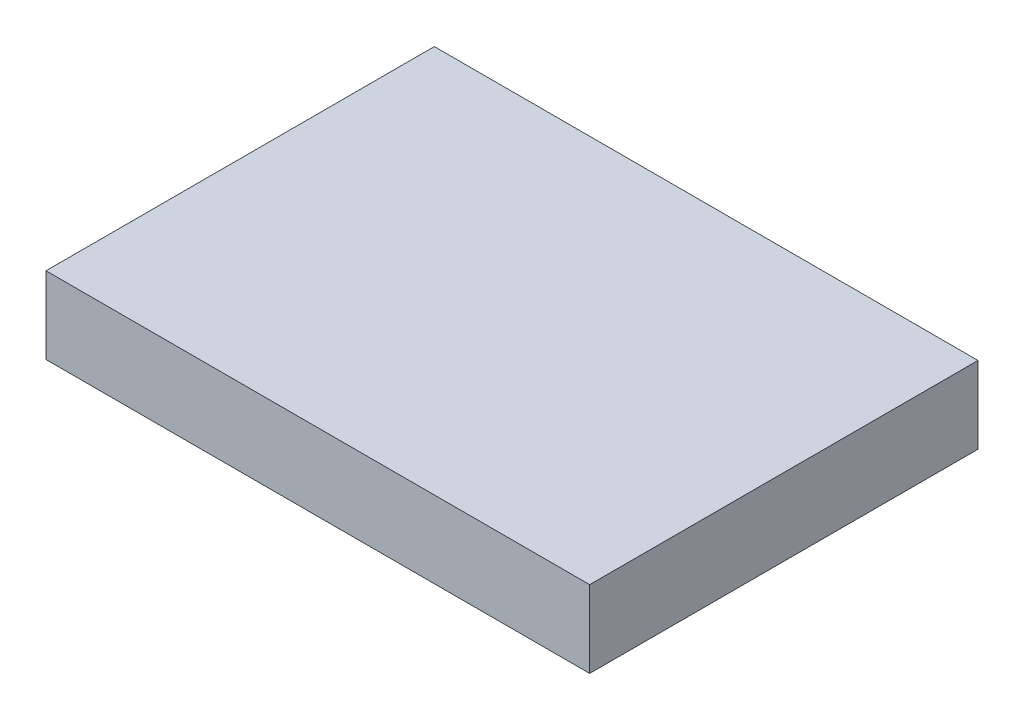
ISO-10303-21;
HEADER;
FILE_DESCRIPTION(('STEP AP214'),'2;1');
FILE_NAME('part.step','',(''),(''),'','','');
FILE_SCHEMA(('AUTOMOTIVE_DESIGN { 1 0 10303 214 1 1 1 1 }'));
ENDSEC;
DATA;
#1=APPLICATION_CONTEXT('core data for automotive mechanical design processes');
#2=APPLICATION_PROTOCOL_DEFINITION('international standard','automotive_design',2000,#1);
#3=PRODUCT_CONTEXT('',#1,'mechanical');
#4=PRODUCT('Part','Part','',(#3));
#5=PRODUCT_RELATED_PRODUCT_CATEGORY('part','',(#4));
#6=PRODUCT_DEFINITION_FORMATION('','',#4);
#7=PRODUCT_DEFINITION_CONTEXT('part definition',#1,'design');
#8=PRODUCT_DEFINITION('design','',#6,#7);
#9=PRODUCT_DEFINITION_SHAPE('','',#8);
#10=(LENGTH_UNIT() NAMED_UNIT(*) SI_UNIT(.MILLI.,.METRE.));
#11=(NAMED_UNIT(*) PLANE_ANGLE_UNIT() SI_UNIT($,.RADIAN.));
#12=(NAMED_UNIT(*) SI_UNIT($,.STERADIAN.) SOLID_ANGLE_UNIT());
#13=UNCERTAINTY_MEASURE_WITH_UNIT(LENGTH_MEASURE(1.E-05),#10,'distance_accuracy_value','');
#14=(GEOMETRIC_REPRESENTATION_CONTEXT(3) GLOBAL_UNCERTAINTY_ASSIGNED_CONTEXT((#13)) GLOBAL_UNIT_ASSIGNED_CONTEXT((#10,
#11,#12)) REPRESENTATION_CONTEXT('',''));
#15=CARTESIAN_POINT('',(0.,0.,0.));
#16=DIRECTION('',(0.,0.,1.));
#17=DIRECTION('',(1.,0.,0.));
#18=AXIS2_PLACEMENT_3D('',#15,#16,#17);
#19=CARTESIAN_POINT('',(0.,0.,25.));
#20=DIRECTION('',(1.,0.,0.));
#21=DIRECTION('',(0.,0.,-1.));
#22=AXIS2_PLACEMENT_3D('',#19,#20,#21);
#23=PLANE('',#22);
#24=DIRECTION('',(0.,-1.,0.));
#25=VECTOR('',#24,1.);
#26=CARTESIAN_POINT('',(0.,0.,-25.));
#27=LINE('',#26,#25);
#28=CARTESIAN_POINT('',(0.,9.9,-25.));
#29=VERTEX_POINT('',#28);
#30=CARTESIAN_POINT('',(0.,0.,-25.));
#31=VERTEX_POINT('',#30);
#32=EDGE_CURVE('E72',#29,#31,#27,.T.);
#33=ORIENTED_EDGE('',*,*,#32,.T.);
#34=DIRECTION('',(0.,0.,-1.));
#35=VECTOR('',#34,1.);
#36=CARTESIAN_POINT('',(0.,0.,25.));
#37=LINE('',#36,#35);
#38=CARTESIAN_POINT('',(0.,0.,25.));
#39=VERTEX_POINT('',#38);
#40=EDGE_CURVE('E11',#39,#31,#37,.T.);
#41=ORIENTED_EDGE('',*,*,#40,.F.);
#42=DIRECTION('',(0.,-1.,0.));
#43=VECTOR('',#42,1.);
#44=CARTESIAN_POINT('',(0.,0.,25.));
#45=LINE('',#44,#43);
#46=CARTESIAN_POINT('',(0.,9.9,25.));
#47=VERTEX_POINT('',#46);
#48=EDGE_CURVE('E90',#47,#39,#45,.T.);
#49=ORIENTED_EDGE('',*,*,#48,.F.);
#50=DIRECTION('',(0.,0.,-1.));
#51=VECTOR('',#50,1.);
#52=CARTESIAN_POINT('',(0.,9.9,25.));
#53=LINE('',#52,#51);
#54=EDGE_CURVE('E84',#47,#29,#53,.T.);
#55=ORIENTED_EDGE('',*,*,#54,.T.);
#56=EDGE_LOOP('',(#33,#41,#49,#55));
#57=FACE_BOUND('',#56,.T.);
#58=ADVANCED_FACE('F28',(#57),#23,.F.);
#59=CARTESIAN_POINT('',(0.,0.,25.));
#60=DIRECTION('',(0.,1.,0.));
#61=DIRECTION('',(-1.,0.,0.));
#62=AXIS2_PLACEMENT_3D('',#59,#60,#61);
#63=PLANE('',#62);
#64=DIRECTION('',(1.,0.,0.));
#65=VECTOR('',#64,1.);
#66=CARTESIAN_POINT('',(0.,0.,-25.));
#67=LINE('',#66,#65);
#68=CARTESIAN_POINT('',(70.,0.,-25.));
#69=VERTEX_POINT('',#68);
#70=EDGE_CURVE('E68',#31,#69,#67,.T.);
#71=ORIENTED_EDGE('',*,*,#70,.T.);
#72=DIRECTION('',(0.,0.,-1.));
#73=VECTOR('',#72,1.);
#74=CARTESIAN_POINT('',(70.,0.,25.));
#75=LINE('',#74,#73);
#76=CARTESIAN_POINT('',(70.,0.,25.));
#77=VERTEX_POINT('',#76);
#78=EDGE_CURVE('E35',#77,#69,#75,.T.);
#79=ORIENTED_EDGE('',*,*,#78,.F.);
#80=DIRECTION('',(1.,0.,0.));
#81=VECTOR('',#80,1.);
#82=CARTESIAN_POINT('',(0.,0.,25.));
#83=LINE('',#82,#81);
#84=EDGE_CURVE('E80',#39,#77,#83,.T.);
#85=ORIENTED_EDGE('',*,*,#84,.F.);
#86=ORIENTED_EDGE('',*,*,#40,.T.);
#87=EDGE_LOOP('',(#71,#79,#85,#86));
#88=FACE_BOUND('',#87,.T.);
#89=ADVANCED_FACE('F79',(#88),#63,.F.);
#90=CARTESIAN_POINT('',(70.,0.,25.));
#91=DIRECTION('',(-1.,0.,0.));
#92=DIRECTION('',(0.,0.,1.));
#93=AXIS2_PLACEMENT_3D('',#90,#91,#92);
#94=PLANE('',#93);
#95=DIRECTION('',(0.,1.,0.));
#96=VECTOR('',#95,1.);
#97=CARTESIAN_POINT('',(70.,0.,-25.));
#98=LINE('',#97,#96);
#99=CARTESIAN_POINT('',(70.,9.9,-25.));
#100=VERTEX_POINT('',#99);
#101=EDGE_CURVE('E73',#69,#100,#98,.T.);
#102=ORIENTED_EDGE('',*,*,#101,.T.);
#103=DIRECTION('',(0.,0.,-1.));
#104=VECTOR('',#103,1.);
#105=CARTESIAN_POINT('',(70.,9.9,25.));
#106=LINE('',#105,#104);
#107=CARTESIAN_POINT('',(70.,9.9,25.));
#108=VERTEX_POINT('',#107);
#109=EDGE_CURVE('E96',#108,#100,#106,.T.);
#110=ORIENTED_EDGE('',*,*,#109,.F.);
#111=DIRECTION('',(0.,1.,0.));
#112=VECTOR('',#111,1.);
#113=CARTESIAN_POINT('',(70.,0.,25.));
#114=LINE('',#113,#112);
#115=EDGE_CURVE('E47',#77,#108,#114,.T.);
#116=ORIENTED_EDGE('',*,*,#115,.F.);
#117=ORIENTED_EDGE('',*,*,#78,.T.);
#118=EDGE_LOOP('',(#102,#110,#116,#117));
#119=FACE_BOUND('',#118,.T.);
#120=ADVANCED_FACE('F99',(#119),#94,.F.);
#121=CARTESIAN_POINT('',(0.,9.9,25.));
#122=DIRECTION('',(0.,-1.,0.));
#123=DIRECTION('',(1.,0.,0.));
#124=AXIS2_PLACEMENT_3D('',#121,#122,#123);
#125=PLANE('',#124);
#126=DIRECTION('',(-1.,0.,0.));
#127=VECTOR('',#126,1.);
#128=CARTESIAN_POINT('',(0.,9.9,-25.));
#129=LINE('',#128,#127);
#130=EDGE_CURVE('E88',#100,#29,#129,.T.);
#131=ORIENTED_EDGE('',*,*,#130,.T.);
#132=ORIENTED_EDGE('',*,*,#54,.F.);
#133=DIRECTION('',(-1.,0.,0.));
#134=VECTOR('',#133,1.);
#135=CARTESIAN_POINT('',(0.,9.9,25.));
#136=LINE('',#135,#134);
#137=EDGE_CURVE('E42',#108,#47,#136,.T.);
#138=ORIENTED_EDGE('',*,*,#137,.F.);
#139=ORIENTED_EDGE('',*,*,#109,.T.);
#140=EDGE_LOOP('',(#131,#132,#138,#139));
#141=FACE_BOUND('',#140,.T.);
#142=ADVANCED_FACE('F101',(#141),#125,.F.);
#143=CARTESIAN_POINT('',(0.,9.9,25.));
#144=DIRECTION('',(0.,0.,-1.));
#145=DIRECTION('',(-1.,0.,0.));
#146=AXIS2_PLACEMENT_3D('',#143,#144,#145);
#147=PLANE('',#146);
#148=ORIENTED_EDGE('',*,*,#48,.T.);
#149=ORIENTED_EDGE('',*,*,#84,.T.);
#150=ORIENTED_EDGE('',*,*,#115,.T.);
#151=ORIENTED_EDGE('',*,*,#137,.T.);
#152=EDGE_LOOP('',(#148,#149,#150,#151));
#153=FACE_BOUND('',#152,.T.);
#154=ADVANCED_FACE('F102',(#153),#147,.F.);
#155=CARTESIAN_POINT('',(0.,9.9,-25.));
#156=DIRECTION('',(0.,0.,-1.));
#157=DIRECTION('',(-1.,0.,0.));
#158=AXIS2_PLACEMENT_3D('',#155,#156,#157);
#159=PLANE('',#158);
#160=ORIENTED_EDGE('',*,*,#32,.F.);
#161=ORIENTED_EDGE('',*,*,#130,.F.);
#162=ORIENTED_EDGE('',*,*,#101,.F.);
#163=ORIENTED_EDGE('',*,*,#70,.F.);
#164=EDGE_LOOP('',(#160,#161,#162,#163));
#165=FACE_BOUND('',#164,.T.);
#166=ADVANCED_FACE('F69',(#165),#159,.T.);
#167=CLOSED_SHELL('',(#58,#89,#120,#142,#154,#166));
#168=MANIFOLD_SOLID_BREP('B2',#167);
#169=ADVANCED_BREP_SHAPE_REPRESENTATION('',(#18,#168),#14);
#170=SHAPE_DEFINITION_REPRESENTATION(#9,#169);
ENDSEC;
END-ISO-10303-21;
